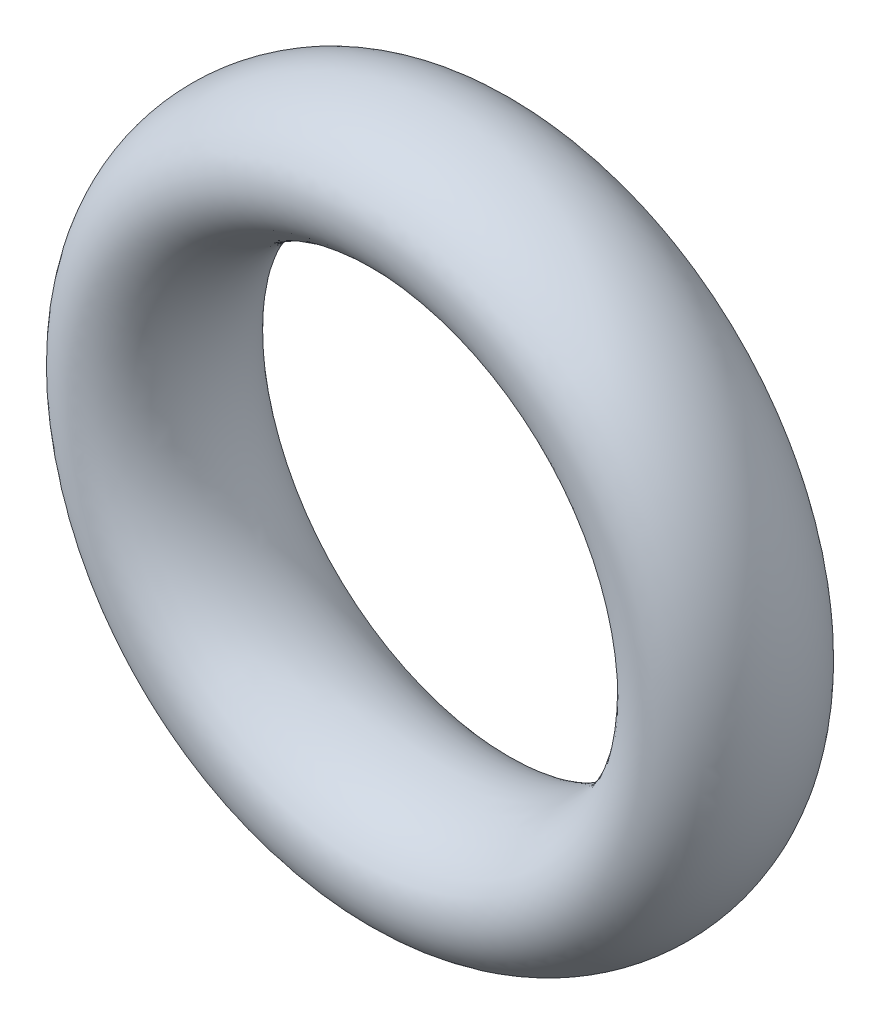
ISO-10303-21;
HEADER;
FILE_DESCRIPTION(('STEP AP214'),'2;1');
FILE_NAME('part.step','',(''),(''),'','','');
FILE_SCHEMA(('AUTOMOTIVE_DESIGN { 1 0 10303 214 1 1 1 1 }'));
ENDSEC;
DATA;
#1=APPLICATION_CONTEXT('core data for automotive mechanical design processes');
#2=APPLICATION_PROTOCOL_DEFINITION('international standard','automotive_design',2000,#1);
#3=PRODUCT_CONTEXT('',#1,'mechanical');
#4=PRODUCT('Part','Part','',(#3));
#5=PRODUCT_RELATED_PRODUCT_CATEGORY('part','',(#4));
#6=PRODUCT_DEFINITION_FORMATION('','',#4);
#7=PRODUCT_DEFINITION_CONTEXT('part definition',#1,'design');
#8=PRODUCT_DEFINITION('design','',#6,#7);
#9=PRODUCT_DEFINITION_SHAPE('','',#8);
#10=(LENGTH_UNIT() NAMED_UNIT(*) SI_UNIT(.MILLI.,.METRE.));
#11=(NAMED_UNIT(*) PLANE_ANGLE_UNIT() SI_UNIT($,.RADIAN.));
#12=(NAMED_UNIT(*) SI_UNIT($,.STERADIAN.) SOLID_ANGLE_UNIT());
#13=UNCERTAINTY_MEASURE_WITH_UNIT(LENGTH_MEASURE(1.E-05),#10,'distance_accuracy_value','');
#14=(GEOMETRIC_REPRESENTATION_CONTEXT(3) GLOBAL_UNCERTAINTY_ASSIGNED_CONTEXT((#13)) GLOBAL_UNIT_ASSIGNED_CONTEXT((#10,
#11,#12)) REPRESENTATION_CONTEXT('',''));
#15=CARTESIAN_POINT('',(0.,0.,0.));
#16=DIRECTION('',(0.,0.,1.));
#17=DIRECTION('',(1.,0.,0.));
#18=AXIS2_PLACEMENT_3D('',#15,#16,#17);
#19=CARTESIAN_POINT('',(0.,3.3,-1.));
#20=DIRECTION('',(1.,0.,0.));
#21=DIRECTION('',(0.,0.,1.));
#22=AXIS2_PLACEMENT_3D('',#19,#20,#21);
#23=ELLIPSE('',#22,1.,0.75);
#24=CARTESIAN_POINT('',(0.,0.,0.));
#25=DIRECTION('',(0.,0.,1.));
#26=AXIS1_PLACEMENT('',#24,#25);
#27=SURFACE_OF_REVOLUTION('',#23,#26);
#28=ADVANCED_FACE('F26',(),#27,.T.);
#29=CLOSED_SHELL('',(#28));
#30=MANIFOLD_SOLID_BREP('B2',#29);
#31=ADVANCED_BREP_SHAPE_REPRESENTATION('',(#18,#30),#14);
#32=SHAPE_DEFINITION_REPRESENTATION(#9,#31);
ENDSEC;
END-ISO-10303-21;
